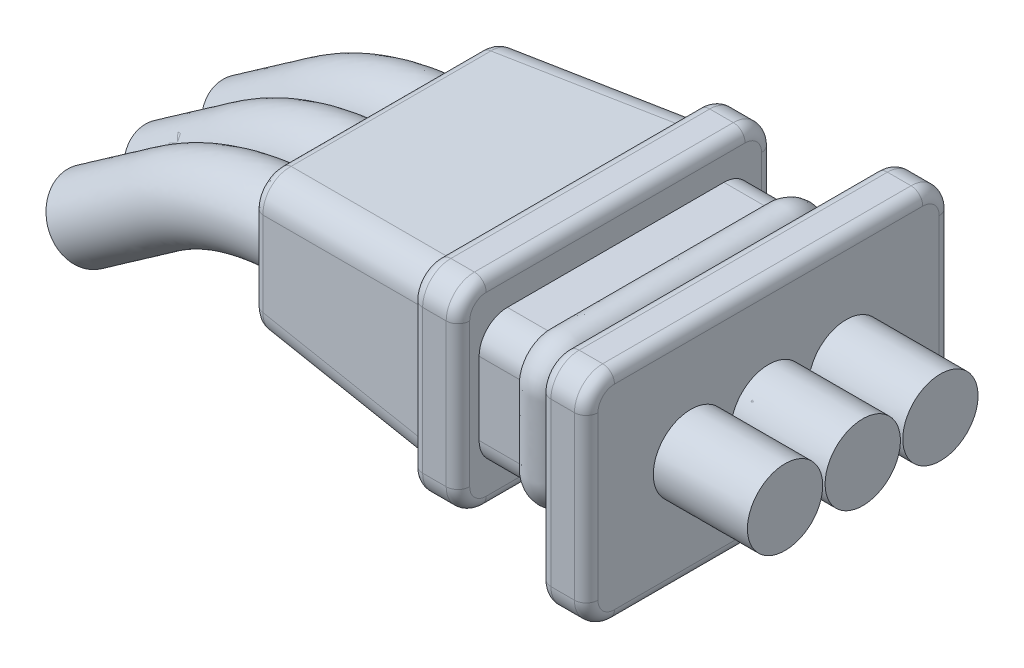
from build123d import *

# Parameters (mm, degrees)
SKETCH1_W            = 7.75
SKETCH1_H            = 4.65
BOSS_EXTRUDE1_DEPTH  = 1
SKETCH2_W            = 5.8
SKETCH2_H            = 2.75
BOSS_EXTRUDE2_DEPTH  = 2.25
SKETCH3_W            = 6.7
SKETCH3_H            = 4.25
BOSS_EXTRUDE3_DEPTH  = 1
SKETCH4_W            = 6.1
SKETCH4_H            = 3.65
BOSS_EXTRUDE4_DEPTH  = 4
BOSS_EXTRUDE4_TAPER  = 5
FILLET1_R            = 0.6
FILLET2_R            = 0.25
CUT_EXTRUDE6_DEPTH   = 10.406580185
SWEEP3_PROFILE_R     = 0.8
LPATTERN1_COUNT      = 2
LPATTERN1_PITCH      = 1.65
LPATTERN1_COUNT_DIR2 = 2
LPATTERN1_PITCH_DIR2 = 1.65


with BuildPart() as part:
    # Sketch1 → Boss-Extrude1 (new body)
    with BuildSketch(Plane(origin=(0, 0, 0), x_dir=(0, 0, -1), z_dir=(1, 0, 0))):
        Rectangle(SKETCH1_W, SKETCH1_H)
    extrude(amount=BOSS_EXTRUDE1_DEPTH)

    # Sketch2 → Boss-Extrude2 (add)
    with BuildSketch(Plane.ZY):
        Rectangle(SKETCH2_W, SKETCH2_H)
    extrude(amount=BOSS_EXTRUDE2_DEPTH)

    # Sketch3 → Boss-Extrude3 (add)
    with BuildSketch(Plane.ZY.offset(2.25)):
        Rectangle(SKETCH3_W, SKETCH3_H)
    extrude(amount=BOSS_EXTRUDE3_DEPTH)

    # Sketch4 → Boss-Extrude4 (add)
    with BuildSketch(Plane.ZY.offset(3.25)):
        Rectangle(SKETCH4_W, SKETCH4_H)
    extrude(amount=BOSS_EXTRUDE4_DEPTH, taper=BOSS_EXTRUDE4_TAPER)

    # Fillet1
    fillet1_edges = [part.edges().sort_by_distance(p)[0] for p in [
        (-1.125, 1.375, -2.9),
        (-1.125, -1.375, -2.9),
        (-1.125, -1.375, 2.9),
        (-1.125, 1.375, 2.9),
        (-2.75, 2.125, -3.35),
        (-2.75, -2.125, -3.35),
        (-2.75, -2.125, 3.35),
        (-2.75, 2.125, 3.35),
        (-5.25, 1.650022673, -2.875022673),
        (-5.25, -1.650022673, -2.875022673),
        (-5.25, -1.650022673, 2.875022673),
        (-5.25, 1.650022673, 2.875022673),
        (0.5, -2.325, -3.875),
        (0.5, -2.325, 3.875),
        (0.5, 2.325, 3.875),
        (0.5, 2.325, -3.875),
    ]]
    fillet(fillet1_edges, radius=FILLET1_R)

    # Sweep2: sweep along a path in Sketch7
    with BuildLine(Plane.ZY) as sweep2_path:
        Line((-2.3, -1.375), (2.3, -1.375))
        ThreePointArc((2.3, -1.375), (2.724264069, -1.199264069), (2.9, -0.775))
        Line((2.9, -0.775), (2.9, 0.775))
        ThreePointArc((2.9, 0.775), (2.724264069, 1.199264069), (2.3, 1.375))
        Line((2.3, 1.375), (-2.3, 1.375))
        ThreePointArc((-2.3, 1.375), (-2.724264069, 1.199264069), (-2.9, 0.775))
        Line((-2.9, 0.775), (-2.9, -0.775))
        ThreePointArc((-2.9, -0.775), (-2.724264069, -1.199264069), (-2.3, -1.375))
    # Sketch5 → Sweep2 (sweep)
    with BuildSketch(Plane(origin=(0, 0, 0), x_dir=(1, 0, 0), z_dir=(0, 1, 0))):
        with BuildLine():
            Line((-0.625, 2.9), (-1.375, 2.9))
            ThreePointArc((-1.375, 2.9), (-1, 3.116506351), (-0.625, 2.9))
        make_face()
    sweep(path=sweep2_path.line)

    # Fillet2
    fillet2_edges = [part.edges().sort_by_distance(p)[0] for p in [
        (0, 2.325, 0),
        (1, 2.325, 0),
        (0, 0, -3.875),
        (0, -2.325, 0),
        (0, 0, 3.875),
        (0, 2.149264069, 3.699264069),
        (0, -2.149264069, 3.699264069),
        (0, -2.149264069, -3.699264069),
        (0, 2.149264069, -3.699264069),
        (1, 0, -3.875),
        (1, 0, 3.875),
        (1, -2.325, 0),
        (1, 2.149264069, 3.699264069),
        (1, -2.149264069, 3.699264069),
        (1, -2.149264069, -3.699264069),
        (1, 2.149264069, -3.699264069),
        (-2.25, 0, -3.35),
        (-3.25, 0, -3.35),
        (-2.25, 2.125, 0),
        (-2.25, 0, 3.35),
        (-2.25, -2.125, 0),
        (-2.25, 1.949264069, 3.174264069),
        (-2.25, -1.949264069, 3.174264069),
        (-2.25, -1.949264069, -3.174264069),
        (-2.25, 1.949264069, -3.174264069),
        (-3.25, 2.125, 0),
        (-3.25, -2.125, 0),
        (-3.25, 0, 3.35),
        (-3.25, 1.949264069, 3.174264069),
        (-3.25, -1.949264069, 3.174264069),
        (-3.25, -1.949264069, -3.174264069),
        (-3.25, 1.949264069, -3.174264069),
        (-7.25, -1.475045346, 0),
        (-7.25, 0, -2.700045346),
        (-7.25, 0, 2.700045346),
        (-7.25, 1.475045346, 0),
        (-7.25, 1.300252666, 2.52525255),
        (-7.25, 1.30025255, -2.525252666),
        (-7.25, -1.300252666, 2.52525255),
        (-7.25, -1.300252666, -2.52525255),
    ]]
    fillet(fillet2_edges, radius=FILLET2_R)

    # Sketch15 → Cut-Extrude6 (cut, through all)
    with BuildSketch(Plane.ZY.offset(7.25)):
        with BuildLine():
            Line((-0.854701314, 0.25), (-0.795298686, 0.25))
            ThreePointArc((-0.795298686, 0.25), (-0.766858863, 0.258876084), (-0.74851641, 0.282352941))
            ThreePointArc((-0.74851641, 0.282352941), (0, 0.8), (0.74851641, 0.282352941))
            ThreePointArc((0.74851641, 0.282352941), (0.766858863, 0.258876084), (0.795298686, 0.25))
            Line((0.795298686, 0.25), (0.854701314, 0.25))
            ThreePointArc((0.854701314, 0.25), (0.883141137, 0.258876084), (0.90148359, 0.282352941))
            ThreePointArc((0.90148359, 0.282352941), (2.45, 0), (0.90148359, -0.282352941))
            ThreePointArc((0.90148359, -0.282352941), (0.883141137, -0.258876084), (0.854701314, -0.25))
            Line((0.854701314, -0.25), (0.795298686, -0.25))
            ThreePointArc((0.795298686, -0.25), (0.766858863, -0.258876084), (0.74851641, -0.282352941))
            ThreePointArc((0.74851641, -0.282352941), (0, -0.8), (-0.74851641, -0.282352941))
            ThreePointArc((-0.74851641, -0.282352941), (-0.766858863, -0.258876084), (-0.795298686, -0.25))
            Line((-0.795298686, -0.25), (-0.854701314, -0.25))
            ThreePointArc((-0.854701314, -0.25), (-0.883141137, -0.258876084), (-0.90148359, -0.282352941))
            ThreePointArc((-0.90148359, -0.282352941), (-2.45, 0), (-0.90148359, 0.282352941))
            ThreePointArc((-0.90148359, 0.282352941), (-0.883141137, 0.258876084), (-0.854701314, 0.25))
        make_face()
    extrude(amount=-CUT_EXTRUDE6_DEPTH, mode=Mode.SUBTRACT)


with BuildPart() as body_2:
    # Sweep3: sweep along a path in Sketch10
    with BuildLine(Plane.XY) as sweep3_path:
        Line((-11.779692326, -2.051392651), (-10.141388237, -0.904239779))
        ThreePointArc((-10.141388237, -0.904239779), (-8.777035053, -0.231415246), (-7.273506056, 0))
        Line((-7.273506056, 0), (1, 0))
        Line((1, 0), (3, 0))
    # Sweep3 profile (on start of the path) → Sweep3 (sweep)
    with BuildSketch(Plane(origin=(-11.779692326, -2.051392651, 0), x_dir=(-0.5735764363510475, 0.8191520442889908, 0), z_dir=(0.8191520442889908, 0.5735764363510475, 0))):
        Circle(SWEEP3_PROFILE_R)
    sweep3 = sweep(path=sweep3_path.line)


with BuildPart() as lpattern1_1:
    # LPattern1: Sweep3 2 × 2
    with Locations(*[Vector(0, 0, 1) * (i * LPATTERN1_PITCH) + Vector(0, 0, -1) * (j * LPATTERN1_PITCH_DIR2) for i in range(LPATTERN1_COUNT) for j in range(LPATTERN1_COUNT_DIR2) if (i, j) != (0, 0)]):
        add(sweep3)


solid = Compound([part.part, body_2.part, lpattern1_1.part])
